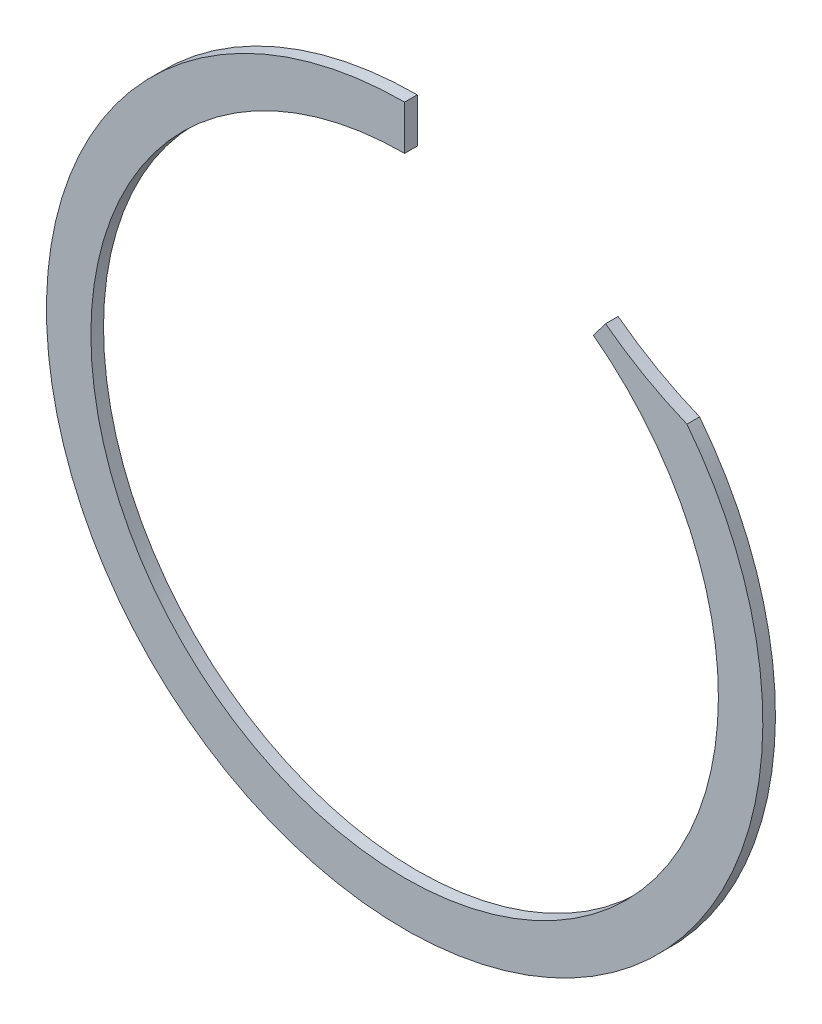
from build123d import *

# Parameters (mm, degrees)
SKETCH1_R          = 18.0213
SKETCH1_R_2        = 15.7861
EXTRUDE1_DEPTH     = 0.635
CUT_EXTRUDE1_DEPTH = 26.49387637


with BuildPart() as part:
    # Sketch1 → Extrude1 (new body)
    with BuildSketch(Plane.XY):
        Circle(SKETCH1_R)
        Circle(SKETCH1_R_2, mode=Mode.SUBTRACT)
    extrude(amount=EXTRUDE1_DEPTH)

    # Sketch2 → Cut-Extrude1 (cut, through all)
    with BuildSketch(Plane.XY):
        with BuildLine():
            Line((0, 0), (0, 18.0213))
            Line((0, 18.0213), (5.800019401, 18.0213))
            ThreePointArc((5.800019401, 18.0213), (34.510706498, 40.57360999), (10.107951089, 13.418209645))
            Line((10.107951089, 13.418209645), (0, 0))
        make_face()
    extrude(amount=CUT_EXTRUDE1_DEPTH, mode=Mode.SUBTRACT)


solid = part.part
